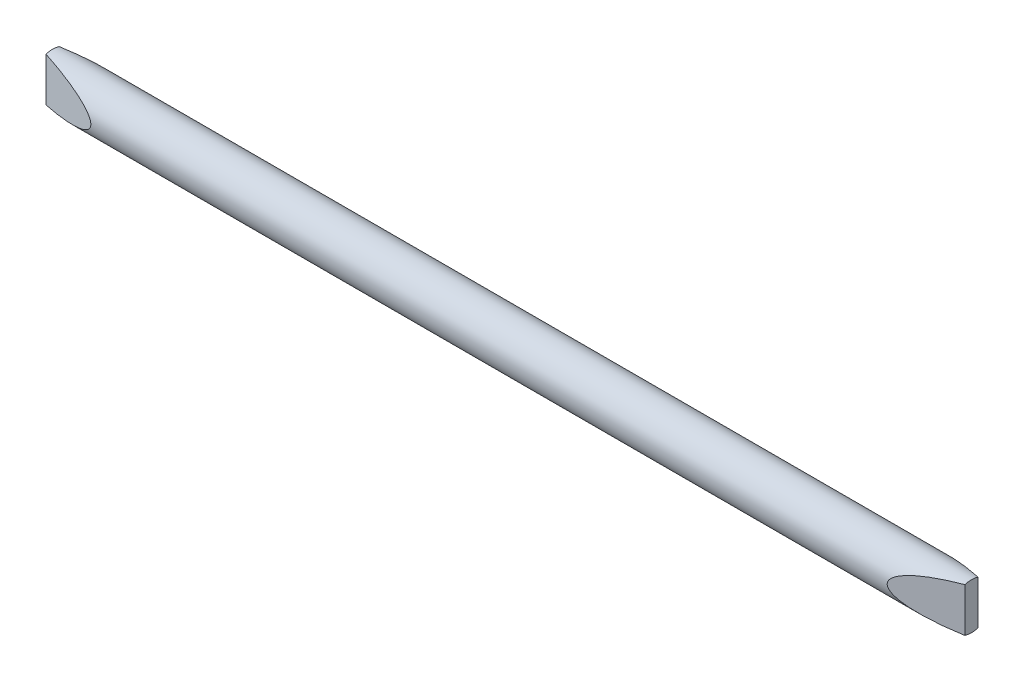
ISO-10303-21;
HEADER;
FILE_DESCRIPTION(('STEP AP214'),'2;1');
FILE_NAME('part.step','',(''),(''),'','','');
FILE_SCHEMA(('AUTOMOTIVE_DESIGN { 1 0 10303 214 1 1 1 1 }'));
ENDSEC;
DATA;
#1=APPLICATION_CONTEXT('core data for automotive mechanical design processes');
#2=APPLICATION_PROTOCOL_DEFINITION('international standard','automotive_design',2000,#1);
#3=PRODUCT_CONTEXT('',#1,'mechanical');
#4=PRODUCT('Part','Part','',(#3));
#5=PRODUCT_RELATED_PRODUCT_CATEGORY('part','',(#4));
#6=PRODUCT_DEFINITION_FORMATION('','',#4);
#7=PRODUCT_DEFINITION_CONTEXT('part definition',#1,'design');
#8=PRODUCT_DEFINITION('design','',#6,#7);
#9=PRODUCT_DEFINITION_SHAPE('','',#8);
#10=(LENGTH_UNIT() NAMED_UNIT(*) SI_UNIT(.MILLI.,.METRE.));
#11=(NAMED_UNIT(*) PLANE_ANGLE_UNIT() SI_UNIT($,.RADIAN.));
#12=(NAMED_UNIT(*) SI_UNIT($,.STERADIAN.) SOLID_ANGLE_UNIT());
#13=UNCERTAINTY_MEASURE_WITH_UNIT(LENGTH_MEASURE(1.E-05),#10,'distance_accuracy_value','');
#14=(GEOMETRIC_REPRESENTATION_CONTEXT(3) GLOBAL_UNCERTAINTY_ASSIGNED_CONTEXT((#13)) GLOBAL_UNIT_ASSIGNED_CONTEXT((#10,
#11,#12)) REPRESENTATION_CONTEXT('',''));
#15=CARTESIAN_POINT('',(0.,0.,0.));
#16=DIRECTION('',(0.,0.,1.));
#17=DIRECTION('',(1.,0.,0.));
#18=AXIS2_PLACEMENT_3D('',#15,#16,#17);
#19=CARTESIAN_POINT('',(0.,2.99999999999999,0.));
#20=DIRECTION('',(1.,0.,0.));
#21=DIRECTION('',(0.,0.,-1.));
#22=AXIS2_PLACEMENT_3D('',#19,#20,#21);
#23=PLANE('',#22);
#24=CARTESIAN_POINT('',(0.,0.,0.));
#25=DIRECTION('',(-1.,0.,0.));
#26=DIRECTION('',(0.,0.,1.));
#27=AXIS2_PLACEMENT_3D('',#24,#25,#26);
#28=CIRCLE('',#27,2.99999999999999);
#29=CARTESIAN_POINT('',(0.,2.87516399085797,0.856406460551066));
#30=VERTEX_POINT('',#29);
#31=CARTESIAN_POINT('',(0.,2.87516399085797,-0.856406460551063));
#32=VERTEX_POINT('',#31);
#33=EDGE_CURVE('E73',#30,#32,#28,.T.);
#34=ORIENTED_EDGE('',*,*,#33,.T.);
#35=DIRECTION('',(0.,1.,0.));
#36=VECTOR('',#35,1.);
#37=CARTESIAN_POINT('',(0.,-15.,-0.856406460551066));
#38=LINE('',#37,#36);
#39=CARTESIAN_POINT('',(0.,-2.87516399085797,-0.856406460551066));
#40=VERTEX_POINT('',#39);
#41=EDGE_CURVE('E45',#40,#32,#38,.T.);
#42=ORIENTED_EDGE('',*,*,#41,.F.);
#43=CARTESIAN_POINT('',(0.,-2.87516399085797,0.856406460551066));
#44=VERTEX_POINT('',#43);
#45=EDGE_CURVE('E51',#40,#44,#28,.T.);
#46=ORIENTED_EDGE('',*,*,#45,.T.);
#47=DIRECTION('',(0.,1.,0.));
#48=VECTOR('',#47,1.);
#49=CARTESIAN_POINT('',(0.,-15.,0.856406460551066));
#50=LINE('',#49,#48);
#51=EDGE_CURVE('E74',#44,#30,#50,.T.);
#52=ORIENTED_EDGE('',*,*,#51,.T.);
#53=EDGE_LOOP('',(#34,#42,#46,#52));
#54=FACE_BOUND('',#53,.T.);
#55=ADVANCED_FACE('F32',(#54),#23,.F.);
#56=CARTESIAN_POINT('',(120.,0.,0.));
#57=DIRECTION('',(-1.,0.,0.));
#58=DIRECTION('',(0.,0.,1.));
#59=AXIS2_PLACEMENT_3D('',#56,#57,#58);
#60=PLANE('',#59);
#61=CARTESIAN_POINT('',(120.,0.,0.));
#62=DIRECTION('',(-1.,0.,0.));
#63=DIRECTION('',(0.,0.,1.));
#64=AXIS2_PLACEMENT_3D('',#61,#62,#63);
#65=CIRCLE('',#64,3.);
#66=CARTESIAN_POINT('',(120.,2.87516399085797,0.856406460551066));
#67=VERTEX_POINT('',#66);
#68=CARTESIAN_POINT('',(120.,2.87516399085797,-0.856406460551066));
#69=VERTEX_POINT('',#68);
#70=EDGE_CURVE('E81',#67,#69,#65,.T.);
#71=ORIENTED_EDGE('',*,*,#70,.F.);
#72=DIRECTION('',(0.,1.,0.));
#73=VECTOR('',#72,1.);
#74=CARTESIAN_POINT('',(120.,-15.,0.856406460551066));
#75=LINE('',#74,#73);
#76=CARTESIAN_POINT('',(120.,-2.87516399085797,0.856406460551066));
#77=VERTEX_POINT('',#76);
#78=EDGE_CURVE('E83',#77,#67,#75,.T.);
#79=ORIENTED_EDGE('',*,*,#78,.F.);
#80=CARTESIAN_POINT('',(120.,-2.87516399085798,-0.856406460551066));
#81=VERTEX_POINT('',#80);
#82=EDGE_CURVE('E87',#81,#77,#65,.T.);
#83=ORIENTED_EDGE('',*,*,#82,.F.);
#84=DIRECTION('',(0.,1.,0.));
#85=VECTOR('',#84,1.);
#86=CARTESIAN_POINT('',(120.,-15.,-0.856406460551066));
#87=LINE('',#86,#85);
#88=EDGE_CURVE('E79',#81,#69,#87,.T.);
#89=ORIENTED_EDGE('',*,*,#88,.T.);
#90=EDGE_LOOP('',(#71,#79,#83,#89));
#91=FACE_BOUND('',#90,.T.);
#92=ADVANCED_FACE('F101',(#91),#60,.F.);
#93=CARTESIAN_POINT('',(0.,0.,0.));
#94=DIRECTION('',(-1.,0.,0.));
#95=DIRECTION('',(0.,0.,1.));
#96=AXIS2_PLACEMENT_3D('',#93,#94,#95);
#97=CYLINDRICAL_SURFACE('',#96,2.99999999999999);
#98=ORIENTED_EDGE('',*,*,#45,.F.);
#99=CARTESIAN_POINT('',(-3.19615242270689,0.,0.));
#100=DIRECTION('',(0.258819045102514,0.,0.96592582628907));
#101=DIRECTION('',(-0.96592582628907,0.,0.258819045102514));
#102=AXIS2_PLACEMENT_3D('',#99,#100,#101);
#103=ELLIPSE('',#102,11.5911099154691,2.99999999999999);
#104=EDGE_CURVE('E11',#40,#32,#103,.T.);
#105=ORIENTED_EDGE('',*,*,#104,.T.);
#106=ORIENTED_EDGE('',*,*,#33,.F.);
#107=CARTESIAN_POINT('',(-3.19615242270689,0.,0.));
#108=DIRECTION('',(0.258819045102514,0.,-0.96592582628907));
#109=DIRECTION('',(-0.96592582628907,0.,-0.258819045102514));
#110=AXIS2_PLACEMENT_3D('',#107,#108,#109);
#111=ELLIPSE('',#110,11.5911099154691,2.99999999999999);
#112=EDGE_CURVE('E39',#30,#44,#111,.T.);
#113=ORIENTED_EDGE('',*,*,#112,.T.);
#114=EDGE_LOOP('',(#98,#105,#106,#113));
#115=FACE_BOUND('',#114,.T.);
#116=CARTESIAN_POINT('',(123.196152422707,0.,0.));
#117=DIRECTION('',(-0.258819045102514,0.,-0.96592582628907));
#118=DIRECTION('',(-0.96592582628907,0.,0.258819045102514));
#119=AXIS2_PLACEMENT_3D('',#116,#117,#118);
#120=ELLIPSE('',#119,11.5911099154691,2.99999999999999);
#121=EDGE_CURVE('E92',#77,#67,#120,.T.);
#122=ORIENTED_EDGE('',*,*,#121,.T.);
#123=ORIENTED_EDGE('',*,*,#70,.T.);
#124=CARTESIAN_POINT('',(123.196152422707,0.,0.));
#125=DIRECTION('',(-0.258819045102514,0.,0.96592582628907));
#126=DIRECTION('',(-0.96592582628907,0.,-0.258819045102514));
#127=AXIS2_PLACEMENT_3D('',#124,#125,#126);
#128=ELLIPSE('',#127,11.5911099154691,2.99999999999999);
#129=EDGE_CURVE('E90',#69,#81,#128,.T.);
#130=ORIENTED_EDGE('',*,*,#129,.T.);
#131=ORIENTED_EDGE('',*,*,#82,.T.);
#132=EDGE_LOOP('',(#122,#123,#130,#131));
#133=FACE_BOUND('',#132,.T.);
#134=ADVANCED_FACE('F77',(#115,#133),#97,.T.);
#135=CARTESIAN_POINT('',(120.,-15.,-0.856406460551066));
#136=DIRECTION('',(-0.258819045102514,0.,0.96592582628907));
#137=DIRECTION('',(0.96592582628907,0.,0.258819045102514));
#138=AXIS2_PLACEMENT_3D('',#135,#136,#137);
#139=PLANE('',#138);
#140=ORIENTED_EDGE('',*,*,#129,.F.);
#141=ORIENTED_EDGE('',*,*,#88,.F.);
#142=EDGE_LOOP('',(#140,#141));
#143=FACE_BOUND('',#142,.T.);
#144=ADVANCED_FACE('F104',(#143),#139,.F.);
#145=CARTESIAN_POINT('',(120.,-15.,0.856406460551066));
#146=DIRECTION('',(-0.258819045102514,0.,-0.96592582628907));
#147=DIRECTION('',(-0.96592582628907,0.,0.258819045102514));
#148=AXIS2_PLACEMENT_3D('',#145,#146,#147);
#149=PLANE('',#148);
#150=ORIENTED_EDGE('',*,*,#121,.F.);
#151=ORIENTED_EDGE('',*,*,#78,.T.);
#152=EDGE_LOOP('',(#150,#151));
#153=FACE_BOUND('',#152,.T.);
#154=ADVANCED_FACE('F99',(#153),#149,.F.);
#155=CARTESIAN_POINT('',(0.,-15.,0.856406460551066));
#156=DIRECTION('',(0.258819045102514,0.,-0.96592582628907));
#157=DIRECTION('',(-0.96592582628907,0.,-0.258819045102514));
#158=AXIS2_PLACEMENT_3D('',#155,#156,#157);
#159=PLANE('',#158);
#160=ORIENTED_EDGE('',*,*,#51,.F.);
#161=ORIENTED_EDGE('',*,*,#112,.F.);
#162=EDGE_LOOP('',(#160,#161));
#163=FACE_BOUND('',#162,.T.);
#164=ADVANCED_FACE('F111',(#163),#159,.F.);
#165=CARTESIAN_POINT('',(0.,-15.,-0.856406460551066));
#166=DIRECTION('',(0.258819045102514,0.,0.96592582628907));
#167=DIRECTION('',(0.96592582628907,0.,-0.258819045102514));
#168=AXIS2_PLACEMENT_3D('',#165,#166,#167);
#169=PLANE('',#168);
#170=ORIENTED_EDGE('',*,*,#41,.T.);
#171=ORIENTED_EDGE('',*,*,#104,.F.);
#172=EDGE_LOOP('',(#170,#171));
#173=FACE_BOUND('',#172,.T.);
#174=ADVANCED_FACE('F69',(#173),#169,.F.);
#175=CLOSED_SHELL('',(#55,#92,#134,#144,#154,#164,#174));
#176=MANIFOLD_SOLID_BREP('B2',#175);
#177=ADVANCED_BREP_SHAPE_REPRESENTATION('',(#18,#176),#14);
#178=SHAPE_DEFINITION_REPRESENTATION(#9,#177);
ENDSEC;
END-ISO-10303-21;
